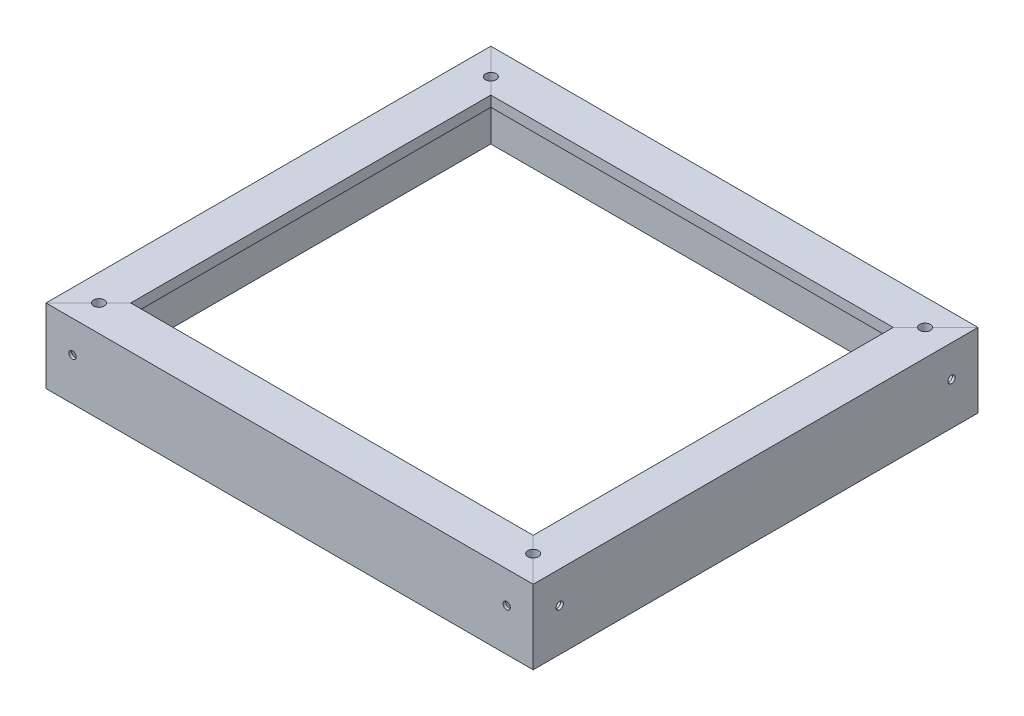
from build123d import *

# Parameters (mm, degrees)
SKETCH3_R            = 1.59004
CUT_EXTRUDE1_DEPTH   = 102.351649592
LPATTERN1_COUNT      = 2
LPATTERN1_PITCH      = 130.175
LPATTERN1_COUNT_DIR2 = 2
LPATTERN1_PITCH_DIR2 = 117.475
BOSS_EXTRUDE1_DEPTH  = 1.27
LPATTERN2_COUNT      = 2
LPATTERN2_PITCH      = 117.4496
LPATTERN3_COUNT      = 2
LPATTERN3_PITCH      = 130.1496


with BuildPart() as part:
    # Sweep1: sweep along a path in Sketch2
    with BuildLine(Plane(origin=(0, 0, 0), x_dir=(1, 0, 0), z_dir=(0, 1, 0))) as sweep1_path:
        Line((-73.025, 66.675), (73.025, 66.675))
        Line((73.025, 66.675), (73.025, -66.675))
        Line((73.025, -66.675), (-73.025, -66.675))
        Line((-73.025, -66.675), (-73.025, 66.675))
    # Sketch1 → Sweep1 (sweep)
    with BuildSketch(Plane.XY):
        Polygon((-73.025, 0), (-73.025, -22.225), (-69.85, -22.225), (-69.85, -3.175), (-60.325, -3.175), (-60.325, 0), align=None)
    sweep(path=sweep1_path.line, transition=Transition.RIGHT)

    # Sketch3 → Cut-Extrude1 (cut, through all)
    with BuildSketch(Plane(origin=(0, 0, 0), x_dir=(1, 0, 0), z_dir=(0, 1, 0))):
        with Locations(Location((-65.0875, -58.7375, 0), (0, 0, 225))):
            Circle(SKETCH3_R)
    cut_extrude1 = extrude(amount=-CUT_EXTRUDE1_DEPTH, mode=Mode.SUBTRACT)

    # LPattern1: Cut-Extrude1 2 × 2
    with Locations(*[(i * LPATTERN1_PITCH, 0, -j * LPATTERN1_PITCH_DIR2) for i in range(LPATTERN1_COUNT) for j in range(LPATTERN1_COUNT_DIR2) if (i, j) != (0, 0)]):
        add(cut_extrude1, mode=Mode.SUBTRACT)

    # Sketch5 → Boss-Extrude1 (add, symmetric)
    with BuildSketch(Plane.XY):
        Polygon((-73.025, 0), (-73.025, -22.225), (-69.85, -22.225), (-69.85, -3.175), (-60.325, -3.175), (-60.325, 0), align=None)
    extrude(amount=BOSS_EXTRUDE1_DEPTH, both=True)

    # Sketch6 → Cut-Revolve1 (revolve, cut)
    with BuildSketch(Plane.XY.offset(58.7248), mode=Mode.PRIVATE) as cut_revolve1_sk:
        with BuildLine():
            Line((-69.85, -8.895953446), (-69.85, -9.525))
            Line((-69.85, -9.525), (-82.589467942, -9.525))
            add(Edge.make_bspline(
                [(-81.812680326, -9.462586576), (-82.189061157, -9.214663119), (-82.589467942, -9.525)],
                knots=[6.016210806, 6.016210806, 6.016210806, 6.718410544, 6.718410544, 6.718410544], degree=2, weights=[1, 0.938995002, 1]))
            add(Edge.make_bspline(
                [(-80.996281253, -9.407133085), (-81.428153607, -8.890302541), (-81.812680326, -9.462586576)],
                knots=[5.519559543, 5.519559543, 5.519559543, 7.155383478, 7.155383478, 7.155383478], degree=2, weights=[1, 0.683746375, 1]))
            add(Edge.make_bspline(
                [(-80.290336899, -9.352106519), (-80.688868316, -8.466359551), (-80.996281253, -9.407133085)],
                knots=[5.224719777, 5.224719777, 5.224719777, 7.466205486, 7.466205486, 7.466205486], degree=2, weights=[1, 0.435013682, 1]))
            add(Edge.make_bspline(
                [(-79.579580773, -9.265961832), (-80.037561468, -7.986305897), (-80.290336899, -9.352106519)],
                knots=[5.133051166, 5.133051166, 5.133051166, 7.626637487, 7.626637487, 7.626637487], degree=2, weights=[1, 0.318363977, 1]))
            add(Edge.make_bspline(
                [(-78.856244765, -9.241627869), (-78.922153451, -8.870800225), (-79.225938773, -8.881019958), (-79.529724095, -8.891239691), (-79.579580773, -9.265961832)],
                knots=[4.931005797, 4.931005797, 4.931005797, 6.310091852, 6.310091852, 7.689177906, 7.689177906, 7.689177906], degree=2, weights=[1, 0.771536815, 1, 0.771536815, 1]))
            add(Edge.make_bspline(
                [(-78.144376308, -9.10853711), (-78.241727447, -8.745089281), (-78.544977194, -8.801784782), (-78.848226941, -8.858480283), (-78.856244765, -9.241627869)],
                knots=[5.035475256, 5.035475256, 5.035475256, 6.43165255, 6.43165255, 7.827829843, 7.827829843, 7.827829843], degree=2, weights=[1, 0.766072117, 1, 0.766072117, 1]))
            add(Edge.make_bspline(
                [(-77.395511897, -9.184118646), (-77.35160872, -8.701784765), (-77.738705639, -8.66271577), (-78.125802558, -8.623646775), (-78.144376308, -9.10853711)],
                knots=[4.599098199, 4.599098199, 4.599098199, 6.202617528, 6.202617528, 7.806136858, 7.806136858, 7.806136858], degree=2, weights=[1, 0.695443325, 1, 0.695443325, 1]))
            add(Edge.make_bspline(
                [(-76.625107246, -8.429799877), (-77.264990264, -8.400534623), (-77.395511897, -9.184118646)],
                knots=[6.246613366, 6.246613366, 6.246613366, 7.648701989, 7.648701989, 7.648701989], degree=2, weights=[1, 0.764169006, 1]))
            Line((-76.625107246, -8.429799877), (-72.230867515, -8.435043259))
            Line((-72.230867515, -8.435043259), (-69.85, -7.14375))
            Line((-69.85, -7.14375), (-69.85, -8.895953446))
        make_face()
    cut_revolve1 = revolve(cut_revolve1_sk.sketch.rotate(Axis((-72.230867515, -9.525, 58.7248), (1, 0, 0)), 90), axis=Axis((-72.230867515, -9.525, 58.7248), (1, 0, 0)), mode=Mode.SUBTRACT)

    # LPattern2: Cut-Revolve1 ×2
    with Locations(*[(0, 0, -i * LPATTERN2_PITCH) for i in range(1, LPATTERN2_COUNT)]):
        add(cut_revolve1, mode=Mode.SUBTRACT)

    # Mirror1: Cut-Revolve1 across plane
    add(cut_revolve1.mirror(Plane(origin=(0, 0, 0), x_dir=(0, 0, 1), z_dir=(1, 0, 0))), mode=Mode.SUBTRACT)

    # Mirror1 copy 1 sketch → Mirror1 copy 1 (revolve, cut)
    with BuildSketch(Plane(origin=(0, 0, -58.7248), x_dir=(-1, 0, 0), z_dir=(0, 0, 1))):
        with BuildLine():
            Line((-69.85, 8.895953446), (-69.85, 9.525))
            Line((-69.85, 9.525), (-82.589467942, 9.525))
            add(Edge.make_bspline(
                [(-81.812680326, 9.462586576), (-82.189061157, 9.214663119), (-82.589467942, 9.525)],
                knots=[6.016210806, 6.016210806, 6.016210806, 6.718410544, 6.718410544, 6.718410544], degree=2, weights=[1, 0.938995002, 1]))
            add(Edge.make_bspline(
                [(-80.996281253, 9.407133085), (-81.428153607, 8.890302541), (-81.812680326, 9.462586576)],
                knots=[5.519559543, 5.519559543, 5.519559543, 7.155383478, 7.155383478, 7.155383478], degree=2, weights=[1, 0.683746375, 1]))
            add(Edge.make_bspline(
                [(-80.290336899, 9.352106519), (-80.688868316, 8.466359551), (-80.996281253, 9.407133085)],
                knots=[5.224719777, 5.224719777, 5.224719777, 7.466205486, 7.466205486, 7.466205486], degree=2, weights=[1, 0.435013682, 1]))
            add(Edge.make_bspline(
                [(-79.579580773, 9.265961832), (-80.037561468, 7.986305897), (-80.290336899, 9.352106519)],
                knots=[5.133051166, 5.133051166, 5.133051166, 7.626637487, 7.626637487, 7.626637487], degree=2, weights=[1, 0.318363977, 1]))
            add(Edge.make_bspline(
                [(-78.856244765, 9.241627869), (-78.922153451, 8.870800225), (-79.225938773, 8.881019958), (-79.529724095, 8.891239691), (-79.579580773, 9.265961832)],
                knots=[4.931005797, 4.931005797, 4.931005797, 6.310091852, 6.310091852, 7.689177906, 7.689177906, 7.689177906], degree=2, weights=[1, 0.771536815, 1, 0.771536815, 1]))
            add(Edge.make_bspline(
                [(-78.144376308, 9.10853711), (-78.241727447, 8.745089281), (-78.544977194, 8.801784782), (-78.848226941, 8.858480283), (-78.856244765, 9.241627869)],
                knots=[5.035475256, 5.035475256, 5.035475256, 6.43165255, 6.43165255, 7.827829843, 7.827829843, 7.827829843], degree=2, weights=[1, 0.766072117, 1, 0.766072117, 1]))
            add(Edge.make_bspline(
                [(-77.395511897, 9.184118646), (-77.35160872, 8.701784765), (-77.738705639, 8.66271577), (-78.125802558, 8.623646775), (-78.144376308, 9.10853711)],
                knots=[4.599098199, 4.599098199, 4.599098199, 6.202617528, 6.202617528, 7.806136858, 7.806136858, 7.806136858], degree=2, weights=[1, 0.695443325, 1, 0.695443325, 1]))
            add(Edge.make_bspline(
                [(-76.625107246, 8.429799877), (-77.264990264, 8.400534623), (-77.395511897, 9.184118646)],
                knots=[6.246613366, 6.246613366, 6.246613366, 7.648701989, 7.648701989, 7.648701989], degree=2, weights=[1, 0.764169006, 1]))
            Line((-76.625107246, 8.429799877), (-72.230867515, 8.435043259))
            Line((-72.230867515, 8.435043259), (-69.85, 7.14375))
            Line((-69.85, 7.14375), (-69.85, 8.895953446))
        make_face()
    revolve(axis=Axis((72.230867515, -9.525, -58.7248), (1, 0, 0)), mode=Mode.SUBTRACT)

    # Sketch7 → Cut-Revolve2 (revolve, cut)
    with BuildSketch(Plane(origin=(-65.0748, 0, 0), x_dir=(0, 0, -1), z_dir=(1, 0, 0)), mode=Mode.PRIVATE) as cut_revolve2_sk:
        with BuildLine():
            Line((-63.5, -8.895953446), (-63.5, -9.525))
            Line((-63.5, -9.525), (-76.239467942, -9.525))
            add(Edge.make_bspline(
                [(-75.462680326, -9.462586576), (-75.839061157, -9.214663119), (-76.239467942, -9.525)],
                knots=[6.016210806, 6.016210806, 6.016210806, 6.718410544, 6.718410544, 6.718410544], degree=2, weights=[1, 0.938995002, 1]))
            add(Edge.make_bspline(
                [(-74.646281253, -9.407133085), (-75.078153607, -8.890302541), (-75.462680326, -9.462586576)],
                knots=[5.519559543, 5.519559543, 5.519559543, 7.155383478, 7.155383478, 7.155383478], degree=2, weights=[1, 0.683746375, 1]))
            add(Edge.make_bspline(
                [(-73.940336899, -9.352106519), (-74.338868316, -8.466359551), (-74.646281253, -9.407133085)],
                knots=[5.224719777, 5.224719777, 5.224719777, 7.466205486, 7.466205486, 7.466205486], degree=2, weights=[1, 0.435013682, 1]))
            add(Edge.make_bspline(
                [(-73.229580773, -9.265961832), (-73.687561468, -7.986305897), (-73.940336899, -9.352106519)],
                knots=[5.133051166, 5.133051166, 5.133051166, 7.626637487, 7.626637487, 7.626637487], degree=2, weights=[1, 0.318363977, 1]))
            add(Edge.make_bspline(
                [(-72.506244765, -9.241627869), (-72.572153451, -8.870800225), (-72.875938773, -8.881019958), (-73.179724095, -8.891239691), (-73.229580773, -9.265961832)],
                knots=[4.931005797, 4.931005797, 4.931005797, 6.310091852, 6.310091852, 7.689177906, 7.689177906, 7.689177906], degree=2, weights=[1, 0.771536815, 1, 0.771536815, 1]))
            add(Edge.make_bspline(
                [(-71.794376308, -9.10853711), (-71.891727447, -8.745089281), (-72.194977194, -8.801784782), (-72.498226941, -8.858480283), (-72.506244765, -9.241627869)],
                knots=[5.035475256, 5.035475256, 5.035475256, 6.43165255, 6.43165255, 7.827829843, 7.827829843, 7.827829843], degree=2, weights=[1, 0.766072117, 1, 0.766072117, 1]))
            add(Edge.make_bspline(
                [(-71.045511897, -9.184118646), (-71.00160872, -8.701784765), (-71.388705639, -8.66271577), (-71.775802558, -8.623646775), (-71.794376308, -9.10853711)],
                knots=[4.599098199, 4.599098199, 4.599098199, 6.202617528, 6.202617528, 7.806136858, 7.806136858, 7.806136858], degree=2, weights=[1, 0.695443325, 1, 0.695443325, 1]))
            add(Edge.make_bspline(
                [(-70.275107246, -8.429799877), (-70.914990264, -8.400534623), (-71.045511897, -9.184118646)],
                knots=[6.246613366, 6.246613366, 6.246613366, 7.648701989, 7.648701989, 7.648701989], degree=2, weights=[1, 0.764169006, 1]))
            Line((-70.275107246, -8.429799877), (-65.880867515, -8.435043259))
            Line((-65.880867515, -8.435043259), (-63.5, -7.14375))
            Line((-63.5, -7.14375), (-63.5, -8.895953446))
        make_face()
    cut_revolve2 = revolve(cut_revolve2_sk.sketch.rotate(Axis((-65.0748, -9.525, 65.880867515), (0, 0, 1)), 270), axis=Axis((-65.0748, -9.525, 65.880867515), (0, 0, 1)), mode=Mode.SUBTRACT)

    # LPattern3: Cut-Revolve2 ×2
    with Locations(*[(i * LPATTERN3_PITCH, 0, 0) for i in range(1, LPATTERN3_COUNT)]):
        add(cut_revolve2, mode=Mode.SUBTRACT)

    # Mirror2: Cut-Revolve2 across plane
    add(cut_revolve2.mirror(Plane.XY), mode=Mode.SUBTRACT)

    # Mirror2 copy 1 sketch → Mirror2 copy 1 (revolve, cut)
    with BuildSketch(Plane(origin=(65.0748, 0, 0), x_dir=(0, 0, 1), z_dir=(1, 0, 0))):
        with BuildLine():
            Line((-63.5, 8.895953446), (-63.5, 9.525))
            Line((-63.5, 9.525), (-76.239467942, 9.525))
            add(Edge.make_bspline(
                [(-75.462680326, 9.462586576), (-75.839061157, 9.214663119), (-76.239467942, 9.525)],
                knots=[6.016210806, 6.016210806, 6.016210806, 6.718410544, 6.718410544, 6.718410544], degree=2, weights=[1, 0.938995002, 1]))
            add(Edge.make_bspline(
                [(-74.646281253, 9.407133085), (-75.078153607, 8.890302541), (-75.462680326, 9.462586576)],
                knots=[5.519559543, 5.519559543, 5.519559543, 7.155383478, 7.155383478, 7.155383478], degree=2, weights=[1, 0.683746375, 1]))
            add(Edge.make_bspline(
                [(-73.940336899, 9.352106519), (-74.338868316, 8.466359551), (-74.646281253, 9.407133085)],
                knots=[5.224719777, 5.224719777, 5.224719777, 7.466205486, 7.466205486, 7.466205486], degree=2, weights=[1, 0.435013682, 1]))
            add(Edge.make_bspline(
                [(-73.229580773, 9.265961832), (-73.687561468, 7.986305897), (-73.940336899, 9.352106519)],
                knots=[5.133051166, 5.133051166, 5.133051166, 7.626637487, 7.626637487, 7.626637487], degree=2, weights=[1, 0.318363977, 1]))
            add(Edge.make_bspline(
                [(-72.506244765, 9.241627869), (-72.572153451, 8.870800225), (-72.875938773, 8.881019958), (-73.179724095, 8.891239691), (-73.229580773, 9.265961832)],
                knots=[4.931005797, 4.931005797, 4.931005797, 6.310091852, 6.310091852, 7.689177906, 7.689177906, 7.689177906], degree=2, weights=[1, 0.771536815, 1, 0.771536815, 1]))
            add(Edge.make_bspline(
                [(-71.794376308, 9.10853711), (-71.891727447, 8.745089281), (-72.194977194, 8.801784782), (-72.498226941, 8.858480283), (-72.506244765, 9.241627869)],
                knots=[5.035475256, 5.035475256, 5.035475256, 6.43165255, 6.43165255, 7.827829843, 7.827829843, 7.827829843], degree=2, weights=[1, 0.766072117, 1, 0.766072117, 1]))
            add(Edge.make_bspline(
                [(-71.045511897, 9.184118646), (-71.00160872, 8.701784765), (-71.388705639, 8.66271577), (-71.775802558, 8.623646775), (-71.794376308, 9.10853711)],
                knots=[4.599098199, 4.599098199, 4.599098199, 6.202617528, 6.202617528, 7.806136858, 7.806136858, 7.806136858], degree=2, weights=[1, 0.695443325, 1, 0.695443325, 1]))
            add(Edge.make_bspline(
                [(-70.275107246, 8.429799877), (-70.914990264, 8.400534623), (-71.045511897, 9.184118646)],
                knots=[6.246613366, 6.246613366, 6.246613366, 7.648701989, 7.648701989, 7.648701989], degree=2, weights=[1, 0.764169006, 1]))
            Line((-70.275107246, 8.429799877), (-65.880867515, 8.435043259))
            Line((-65.880867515, 8.435043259), (-63.5, 7.14375))
            Line((-63.5, 7.14375), (-63.5, 8.895953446))
        make_face()
    revolve(axis=Axis((65.0748, -9.525, -65.880867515), (0, 0, 1)), mode=Mode.SUBTRACT)


solid = part.part
